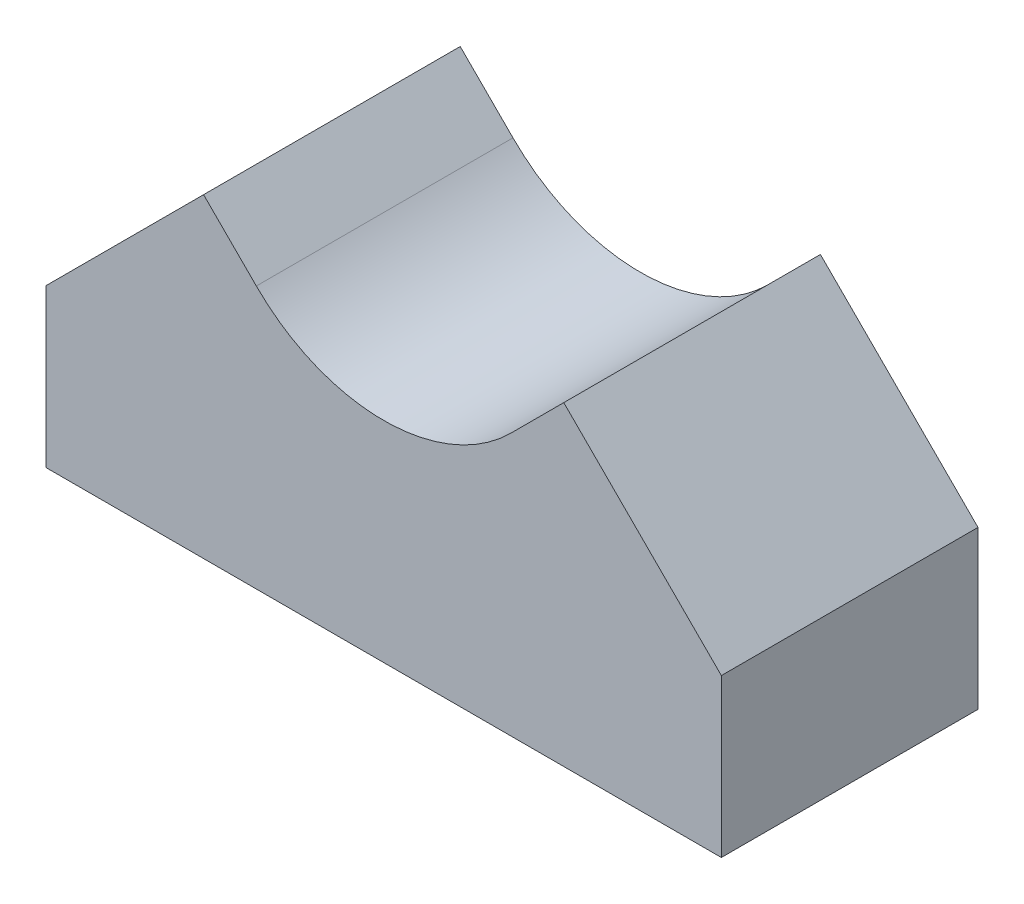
ISO-10303-21;
HEADER;
FILE_DESCRIPTION(('STEP AP214'),'2;1');
FILE_NAME('part.step','',(''),(''),'','','');
FILE_SCHEMA(('AUTOMOTIVE_DESIGN { 1 0 10303 214 1 1 1 1 }'));
ENDSEC;
DATA;
#1=APPLICATION_CONTEXT('core data for automotive mechanical design processes');
#2=APPLICATION_PROTOCOL_DEFINITION('international standard','automotive_design',2000,#1);
#3=PRODUCT_CONTEXT('',#1,'mechanical');
#4=PRODUCT('Part','Part','',(#3));
#5=PRODUCT_RELATED_PRODUCT_CATEGORY('part','',(#4));
#6=PRODUCT_DEFINITION_FORMATION('','',#4);
#7=PRODUCT_DEFINITION_CONTEXT('part definition',#1,'design');
#8=PRODUCT_DEFINITION('design','',#6,#7);
#9=PRODUCT_DEFINITION_SHAPE('','',#8);
#10=(LENGTH_UNIT() NAMED_UNIT(*) SI_UNIT(.MILLI.,.METRE.));
#11=(NAMED_UNIT(*) PLANE_ANGLE_UNIT() SI_UNIT($,.RADIAN.));
#12=(NAMED_UNIT(*) SI_UNIT($,.STERADIAN.) SOLID_ANGLE_UNIT());
#13=UNCERTAINTY_MEASURE_WITH_UNIT(LENGTH_MEASURE(1.E-05),#10,'distance_accuracy_value','');
#14=(GEOMETRIC_REPRESENTATION_CONTEXT(3) GLOBAL_UNCERTAINTY_ASSIGNED_CONTEXT((#13)) GLOBAL_UNIT_ASSIGNED_CONTEXT((#10,
#11,#12)) REPRESENTATION_CONTEXT('',''));
#15=CARTESIAN_POINT('',(0.,0.,0.));
#16=DIRECTION('',(0.,0.,1.));
#17=DIRECTION('',(1.,0.,0.));
#18=AXIS2_PLACEMENT_3D('',#15,#16,#17);
#19=CARTESIAN_POINT('',(75.,86.5685424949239,57.));
#20=DIRECTION('',(0.,0.,1.));
#21=DIRECTION('',(1.,0.,0.));
#22=AXIS2_PLACEMENT_3D('',#19,#20,#21);
#23=CYLINDRICAL_SURFACE('',#22,40.);
#24=DIRECTION('',(0.,0.,-1.));
#25=VECTOR('',#24,1.);
#26=CARTESIAN_POINT('',(46.7157287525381,58.284271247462,57.));
#27=LINE('',#26,#25);
#28=CARTESIAN_POINT('',(46.7157287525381,58.284271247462,57.));
#29=VERTEX_POINT('',#28);
#30=CARTESIAN_POINT('',(46.7157287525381,58.284271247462,0.));
#31=VERTEX_POINT('',#30);
#32=EDGE_CURVE('E112',#29,#31,#27,.T.);
#33=ORIENTED_EDGE('',*,*,#32,.F.);
#34=CARTESIAN_POINT('',(75.,86.5685424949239,57.));
#35=DIRECTION('',(0.,0.,-1.));
#36=DIRECTION('',(-1.,0.,0.));
#37=AXIS2_PLACEMENT_3D('',#34,#35,#36);
#38=CIRCLE('',#37,40.);
#39=CARTESIAN_POINT('',(103.284271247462,58.284271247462,57.));
#40=VERTEX_POINT('',#39);
#41=EDGE_CURVE('E40',#29,#40,#38,.F.);
#42=ORIENTED_EDGE('',*,*,#41,.T.);
#43=DIRECTION('',(0.,0.,-1.));
#44=VECTOR('',#43,1.);
#45=CARTESIAN_POINT('',(103.284271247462,58.284271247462,57.));
#46=LINE('',#45,#44);
#47=CARTESIAN_POINT('',(103.284271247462,58.284271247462,0.));
#48=VERTEX_POINT('',#47);
#49=EDGE_CURVE('E158',#48,#40,#46,.F.);
#50=ORIENTED_EDGE('',*,*,#49,.F.);
#51=CARTESIAN_POINT('',(75.,86.5685424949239,0.));
#52=DIRECTION('',(0.,0.,-1.));
#53=DIRECTION('',(-1.,0.,0.));
#54=AXIS2_PLACEMENT_3D('',#51,#52,#53);
#55=CIRCLE('',#54,40.);
#56=EDGE_CURVE('E11',#48,#31,#55,.T.);
#57=ORIENTED_EDGE('',*,*,#56,.T.);
#58=EDGE_LOOP('',(#33,#42,#50,#57));
#59=FACE_BOUND('',#58,.T.);
#60=ADVANCED_FACE('F33',(#59),#23,.F.);
#61=CARTESIAN_POINT('',(150.,0.,57.));
#62=DIRECTION('',(0.,1.,0.));
#63=DIRECTION('',(-1.,0.,0.));
#64=AXIS2_PLACEMENT_3D('',#61,#62,#63);
#65=PLANE('',#64);
#66=DIRECTION('',(1.,0.,0.));
#67=VECTOR('',#66,1.);
#68=CARTESIAN_POINT('',(150.,0.,0.));
#69=LINE('',#68,#67);
#70=CARTESIAN_POINT('',(0.,0.,0.));
#71=VERTEX_POINT('',#70);
#72=CARTESIAN_POINT('',(150.,0.,0.));
#73=VERTEX_POINT('',#72);
#74=EDGE_CURVE('E99',#71,#73,#69,.T.);
#75=ORIENTED_EDGE('',*,*,#74,.T.);
#76=DIRECTION('',(0.,0.,-1.));
#77=VECTOR('',#76,1.);
#78=CARTESIAN_POINT('',(150.,0.,57.));
#79=LINE('',#78,#77);
#80=CARTESIAN_POINT('',(150.,0.,57.));
#81=VERTEX_POINT('',#80);
#82=EDGE_CURVE('E106',#81,#73,#79,.T.);
#83=ORIENTED_EDGE('',*,*,#82,.F.);
#84=DIRECTION('',(1.,0.,0.));
#85=VECTOR('',#84,1.);
#86=CARTESIAN_POINT('',(150.,0.,57.));
#87=LINE('',#86,#85);
#88=CARTESIAN_POINT('',(0.,0.,57.));
#89=VERTEX_POINT('',#88);
#90=EDGE_CURVE('E131',#89,#81,#87,.T.);
#91=ORIENTED_EDGE('',*,*,#90,.F.);
#92=DIRECTION('',(0.,0.,-1.));
#93=VECTOR('',#92,1.);
#94=CARTESIAN_POINT('',(0.,0.,57.));
#95=LINE('',#94,#93);
#96=EDGE_CURVE('E118',#89,#71,#95,.T.);
#97=ORIENTED_EDGE('',*,*,#96,.T.);
#98=EDGE_LOOP('',(#75,#83,#91,#97));
#99=FACE_BOUND('',#98,.T.);
#100=ADVANCED_FACE('F116',(#99),#65,.F.);
#101=CARTESIAN_POINT('',(150.,0.,57.));
#102=DIRECTION('',(-1.,0.,0.));
#103=DIRECTION('',(0.,0.,1.));
#104=AXIS2_PLACEMENT_3D('',#101,#102,#103);
#105=PLANE('',#104);
#106=DIRECTION('',(0.,1.,0.));
#107=VECTOR('',#106,1.);
#108=CARTESIAN_POINT('',(150.,0.,0.));
#109=LINE('',#108,#107);
#110=CARTESIAN_POINT('',(150.,35.,0.));
#111=VERTEX_POINT('',#110);
#112=EDGE_CURVE('E94',#73,#111,#109,.T.);
#113=ORIENTED_EDGE('',*,*,#112,.T.);
#114=DIRECTION('',(0.,0.,-1.));
#115=VECTOR('',#114,1.);
#116=CARTESIAN_POINT('',(150.,35.,57.));
#117=LINE('',#116,#115);
#118=CARTESIAN_POINT('',(150.,35.,57.));
#119=VERTEX_POINT('',#118);
#120=EDGE_CURVE('E113',#119,#111,#117,.T.);
#121=ORIENTED_EDGE('',*,*,#120,.F.);
#122=DIRECTION('',(0.,1.,0.));
#123=VECTOR('',#122,1.);
#124=CARTESIAN_POINT('',(150.,0.,57.));
#125=LINE('',#124,#123);
#126=EDGE_CURVE('E108',#81,#119,#125,.T.);
#127=ORIENTED_EDGE('',*,*,#126,.F.);
#128=ORIENTED_EDGE('',*,*,#82,.T.);
#129=EDGE_LOOP('',(#113,#121,#127,#128));
#130=FACE_BOUND('',#129,.T.);
#131=ADVANCED_FACE('F107',(#130),#105,.F.);
#132=CARTESIAN_POINT('',(150.,35.,57.));
#133=DIRECTION('',(-0.707106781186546,-0.707106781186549,0.));
#134=DIRECTION('',(0.707106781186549,-0.707106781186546,0.));
#135=AXIS2_PLACEMENT_3D('',#132,#133,#134);
#136=PLANE('',#135);
#137=DIRECTION('',(-0.707106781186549,0.707106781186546,0.));
#138=VECTOR('',#137,1.);
#139=CARTESIAN_POINT('',(150.,35.,0.));
#140=LINE('',#139,#138);
#141=CARTESIAN_POINT('',(115.,70.,0.));
#142=VERTEX_POINT('',#141);
#143=EDGE_CURVE('E100',#111,#142,#140,.T.);
#144=ORIENTED_EDGE('',*,*,#143,.T.);
#145=DIRECTION('',(0.,0.,-1.));
#146=VECTOR('',#145,1.);
#147=CARTESIAN_POINT('',(115.,70.,57.));
#148=LINE('',#147,#146);
#149=CARTESIAN_POINT('',(115.,70.,57.));
#150=VERTEX_POINT('',#149);
#151=EDGE_CURVE('E152',#150,#142,#148,.T.);
#152=ORIENTED_EDGE('',*,*,#151,.F.);
#153=DIRECTION('',(-0.707106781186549,0.707106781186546,0.));
#154=VECTOR('',#153,1.);
#155=CARTESIAN_POINT('',(150.,35.,57.));
#156=LINE('',#155,#154);
#157=EDGE_CURVE('E134',#119,#150,#156,.T.);
#158=ORIENTED_EDGE('',*,*,#157,.F.);
#159=ORIENTED_EDGE('',*,*,#120,.T.);
#160=EDGE_LOOP('',(#144,#152,#158,#159));
#161=FACE_BOUND('',#160,.T.);
#162=ADVANCED_FACE('F167',(#161),#136,.F.);
#163=CARTESIAN_POINT('',(115.,70.,57.));
#164=DIRECTION('',(0.707106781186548,-0.707106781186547,0.));
#165=DIRECTION('',(0.707106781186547,0.707106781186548,0.));
#166=AXIS2_PLACEMENT_3D('',#163,#164,#165);
#167=PLANE('',#166);
#168=DIRECTION('',(-0.707106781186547,-0.707106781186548,0.));
#169=VECTOR('',#168,1.);
#170=CARTESIAN_POINT('',(115.,70.,0.));
#171=LINE('',#170,#169);
#172=EDGE_CURVE('E122',#142,#48,#171,.T.);
#173=ORIENTED_EDGE('',*,*,#172,.T.);
#174=ORIENTED_EDGE('',*,*,#49,.T.);
#175=DIRECTION('',(-0.707106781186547,-0.707106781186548,0.));
#176=VECTOR('',#175,1.);
#177=CARTESIAN_POINT('',(115.,70.,57.));
#178=LINE('',#177,#176);
#179=EDGE_CURVE('E136',#150,#40,#178,.T.);
#180=ORIENTED_EDGE('',*,*,#179,.F.);
#181=ORIENTED_EDGE('',*,*,#151,.T.);
#182=EDGE_LOOP('',(#173,#174,#180,#181));
#183=FACE_BOUND('',#182,.T.);
#184=ADVANCED_FACE('F161',(#183),#167,.F.);
#185=CARTESIAN_POINT('',(35.0000000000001,70.,57.));
#186=DIRECTION('',(-0.707106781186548,-0.707106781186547,0.));
#187=DIRECTION('',(0.707106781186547,-0.707106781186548,0.));
#188=AXIS2_PLACEMENT_3D('',#185,#186,#187);
#189=PLANE('',#188);
#190=DIRECTION('',(-0.707106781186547,0.707106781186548,0.));
#191=VECTOR('',#190,1.);
#192=CARTESIAN_POINT('',(35.0000000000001,70.,57.));
#193=LINE('',#192,#191);
#194=CARTESIAN_POINT('',(35.0000000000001,70.,57.));
#195=VERTEX_POINT('',#194);
#196=EDGE_CURVE('E139',#29,#195,#193,.T.);
#197=ORIENTED_EDGE('',*,*,#196,.F.);
#198=ORIENTED_EDGE('',*,*,#32,.T.);
#199=DIRECTION('',(-0.707106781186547,0.707106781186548,0.));
#200=VECTOR('',#199,1.);
#201=CARTESIAN_POINT('',(35.0000000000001,70.,0.));
#202=LINE('',#201,#200);
#203=CARTESIAN_POINT('',(35.0000000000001,70.,0.));
#204=VERTEX_POINT('',#203);
#205=EDGE_CURVE('E125',#31,#204,#202,.T.);
#206=ORIENTED_EDGE('',*,*,#205,.T.);
#207=DIRECTION('',(0.,0.,-1.));
#208=VECTOR('',#207,1.);
#209=CARTESIAN_POINT('',(35.0000000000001,70.,57.));
#210=LINE('',#209,#208);
#211=EDGE_CURVE('E149',#195,#204,#210,.T.);
#212=ORIENTED_EDGE('',*,*,#211,.F.);
#213=EDGE_LOOP('',(#197,#198,#206,#212));
#214=FACE_BOUND('',#213,.T.);
#215=ADVANCED_FACE('F174',(#214),#189,.F.);
#216=CARTESIAN_POINT('',(0.,35.,57.));
#217=DIRECTION('',(0.707106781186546,-0.707106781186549,0.));
#218=DIRECTION('',(0.707106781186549,0.707106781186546,0.));
#219=AXIS2_PLACEMENT_3D('',#216,#217,#218);
#220=PLANE('',#219);
#221=DIRECTION('',(-0.707106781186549,-0.707106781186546,0.));
#222=VECTOR('',#221,1.);
#223=CARTESIAN_POINT('',(0.,35.,0.));
#224=LINE('',#223,#222);
#225=CARTESIAN_POINT('',(0.,35.,0.));
#226=VERTEX_POINT('',#225);
#227=EDGE_CURVE('E127',#204,#226,#224,.T.);
#228=ORIENTED_EDGE('',*,*,#227,.T.);
#229=DIRECTION('',(0.,0.,-1.));
#230=VECTOR('',#229,1.);
#231=CARTESIAN_POINT('',(0.,35.,57.));
#232=LINE('',#231,#230);
#233=CARTESIAN_POINT('',(0.,35.,57.));
#234=VERTEX_POINT('',#233);
#235=EDGE_CURVE('E146',#234,#226,#232,.T.);
#236=ORIENTED_EDGE('',*,*,#235,.F.);
#237=DIRECTION('',(-0.707106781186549,-0.707106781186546,0.));
#238=VECTOR('',#237,1.);
#239=CARTESIAN_POINT('',(0.,35.,57.));
#240=LINE('',#239,#238);
#241=EDGE_CURVE('E141',#195,#234,#240,.T.);
#242=ORIENTED_EDGE('',*,*,#241,.F.);
#243=ORIENTED_EDGE('',*,*,#211,.T.);
#244=EDGE_LOOP('',(#228,#236,#242,#243));
#245=FACE_BOUND('',#244,.T.);
#246=ADVANCED_FACE('F188',(#245),#220,.F.);
#247=CARTESIAN_POINT('',(0.,0.,57.));
#248=DIRECTION('',(1.,0.,0.));
#249=DIRECTION('',(0.,0.,-1.));
#250=AXIS2_PLACEMENT_3D('',#247,#248,#249);
#251=PLANE('',#250);
#252=DIRECTION('',(0.,-1.,0.));
#253=VECTOR('',#252,1.);
#254=CARTESIAN_POINT('',(0.,0.,0.));
#255=LINE('',#254,#253);
#256=EDGE_CURVE('E129',#226,#71,#255,.T.);
#257=ORIENTED_EDGE('',*,*,#256,.T.);
#258=ORIENTED_EDGE('',*,*,#96,.F.);
#259=DIRECTION('',(0.,-1.,0.));
#260=VECTOR('',#259,1.);
#261=CARTESIAN_POINT('',(0.,0.,57.));
#262=LINE('',#261,#260);
#263=EDGE_CURVE('E143',#234,#89,#262,.T.);
#264=ORIENTED_EDGE('',*,*,#263,.F.);
#265=ORIENTED_EDGE('',*,*,#235,.T.);
#266=EDGE_LOOP('',(#257,#258,#264,#265));
#267=FACE_BOUND('',#266,.T.);
#268=ADVANCED_FACE('F191',(#267),#251,.F.);
#269=CARTESIAN_POINT('',(0.,0.,57.));
#270=DIRECTION('',(0.,0.,-1.));
#271=DIRECTION('',(-1.,0.,0.));
#272=AXIS2_PLACEMENT_3D('',#269,#270,#271);
#273=PLANE('',#272);
#274=ORIENTED_EDGE('',*,*,#41,.F.);
#275=ORIENTED_EDGE('',*,*,#196,.T.);
#276=ORIENTED_EDGE('',*,*,#241,.T.);
#277=ORIENTED_EDGE('',*,*,#263,.T.);
#278=ORIENTED_EDGE('',*,*,#90,.T.);
#279=ORIENTED_EDGE('',*,*,#126,.T.);
#280=ORIENTED_EDGE('',*,*,#157,.T.);
#281=ORIENTED_EDGE('',*,*,#179,.T.);
#282=EDGE_LOOP('',(#274,#275,#276,#277,#278,#279,#280,#281));
#283=FACE_BOUND('',#282,.T.);
#284=ADVANCED_FACE('F163',(#283),#273,.F.);
#285=CARTESIAN_POINT('',(0.,0.,0.));
#286=DIRECTION('',(0.,0.,-1.));
#287=DIRECTION('',(-1.,0.,0.));
#288=AXIS2_PLACEMENT_3D('',#285,#286,#287);
#289=PLANE('',#288);
#290=ORIENTED_EDGE('',*,*,#74,.F.);
#291=ORIENTED_EDGE('',*,*,#256,.F.);
#292=ORIENTED_EDGE('',*,*,#227,.F.);
#293=ORIENTED_EDGE('',*,*,#205,.F.);
#294=ORIENTED_EDGE('',*,*,#56,.F.);
#295=ORIENTED_EDGE('',*,*,#172,.F.);
#296=ORIENTED_EDGE('',*,*,#143,.F.);
#297=ORIENTED_EDGE('',*,*,#112,.F.);
#298=EDGE_LOOP('',(#290,#291,#292,#293,#294,#295,#296,#297));
#299=FACE_BOUND('',#298,.T.);
#300=ADVANCED_FACE('F96',(#299),#289,.T.);
#301=CLOSED_SHELL('',(#60,#100,#131,#162,#184,#215,#246,#268,#284,#300));
#302=MANIFOLD_SOLID_BREP('B2',#301);
#303=ADVANCED_BREP_SHAPE_REPRESENTATION('',(#18,#302),#14);
#304=SHAPE_DEFINITION_REPRESENTATION(#9,#303);
ENDSEC;
END-ISO-10303-21;
